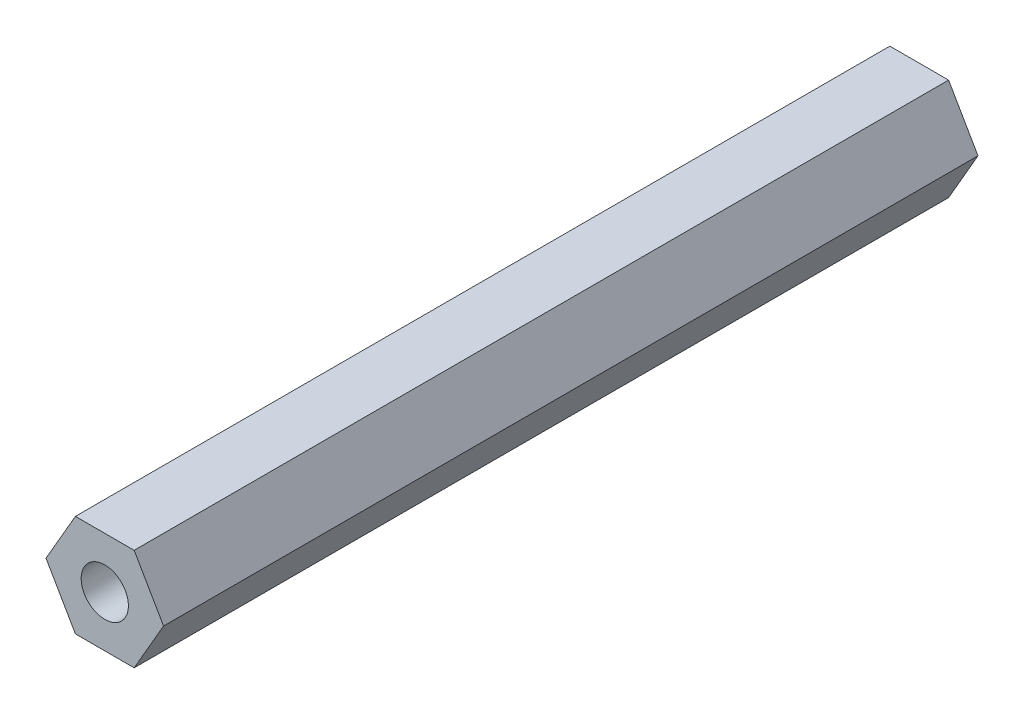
from build123d import *

# Parameters (mm, degrees)
BOSS_EXTRUDE1_DEPTH   = 50.8
F_4_CLEARANCE_HOLE1_D = 2.9464


with BuildPart() as part:
    # Sketch1 → Boss-Extrude1 (new body)
    with BuildSketch(Plane.XY):
        Polygon((1.833087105, 3.175), (-1.833087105, 3.175), (-3.666174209, 0), (-1.833087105, -3.175), (1.833087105, -3.175), (3.666174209, 0), align=None)
    extrude(amount=BOSS_EXTRUDE1_DEPTH)

    # 4 Clearance Hole1 (through all)
    with Locations(Plane.XY.offset(50.8)):
        with Locations((0, 0)):
            Hole(F_4_CLEARANCE_HOLE1_D / 2)


solid = part.part
